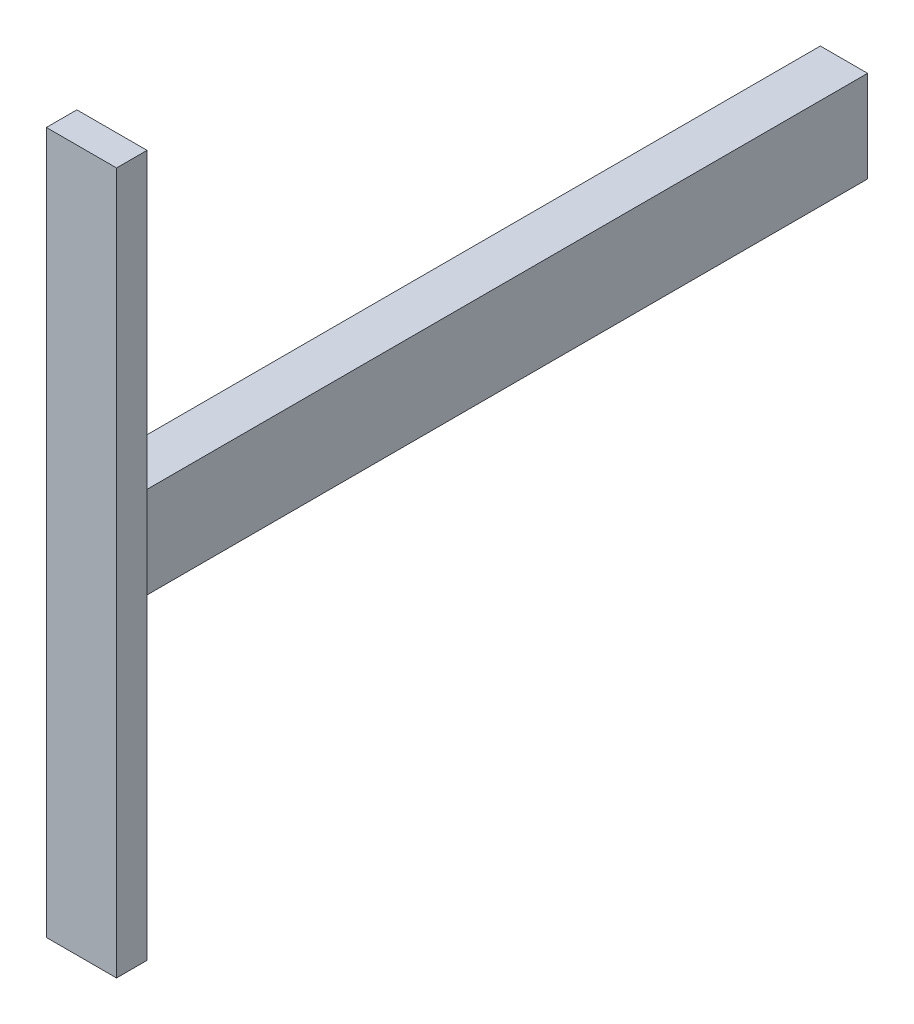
from build123d import *

# Parameters (mm, degrees)
SKETCH1_W           = 58.42
SKETCH1_H           = 25.4
BOSS_EXTRUDE1_DEPTH = 584.2
SKETCH2_W           = 39.37
SKETCH2_H           = 76.2
SKETCH2_W_2         = 33.02
SKETCH2_H_2         = 69.85
BOSS_EXTRUDE2_DEPTH = 609.6


with BuildPart() as part:
    # Sketch1 → Boss-Extrude1 (new body)
    with BuildSketch(Plane(origin=(0, 0, 0), x_dir=(1, 0, 0), z_dir=(0, 1, 0))):
        Rectangle(SKETCH1_W, SKETCH1_H)
    extrude(amount=BOSS_EXTRUDE1_DEPTH)

    # Sketch2 → Boss-Extrude2 (add)
    with BuildSketch(Plane(origin=(0, 0, -12.7), x_dir=(-1, 0, 0), z_dir=(0, 0, -1))):
        with Locations((0, 292.1)):
            Rectangle(SKETCH2_W, SKETCH2_H)
        with Locations((0, 292.1)):
            Rectangle(SKETCH2_W_2, SKETCH2_H_2, mode=Mode.SUBTRACT)
    extrude(amount=BOSS_EXTRUDE2_DEPTH)


solid = part.part
